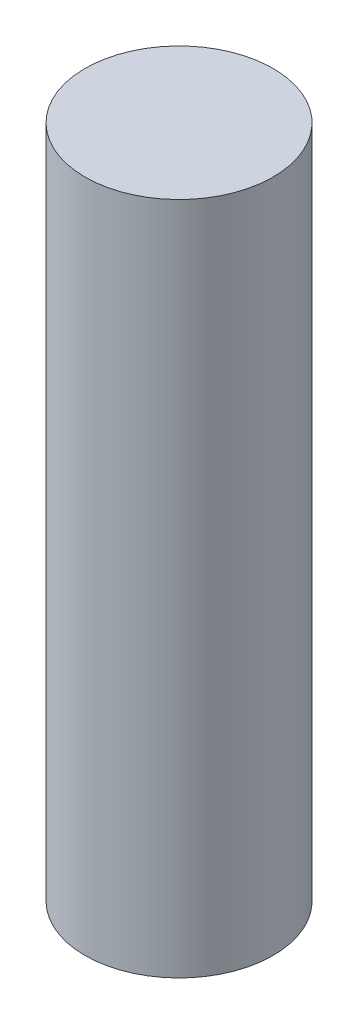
from build123d import *

# Parameters (mm, degrees)
SKETCH1_R           = 30
BOSS_EXTRUDE1_DEPTH = 215


with BuildPart() as part:
    # Sketch1 → Boss-Extrude1 (new body)
    with BuildSketch(Plane(origin=(0, 0, 0), x_dir=(1, 0, 0), z_dir=(0, 1, 0))):
        with Locations(Location((0, 0, 0), (0, 0, 270))):
            Circle(SKETCH1_R)
    extrude(amount=BOSS_EXTRUDE1_DEPTH)


solid = part.part
